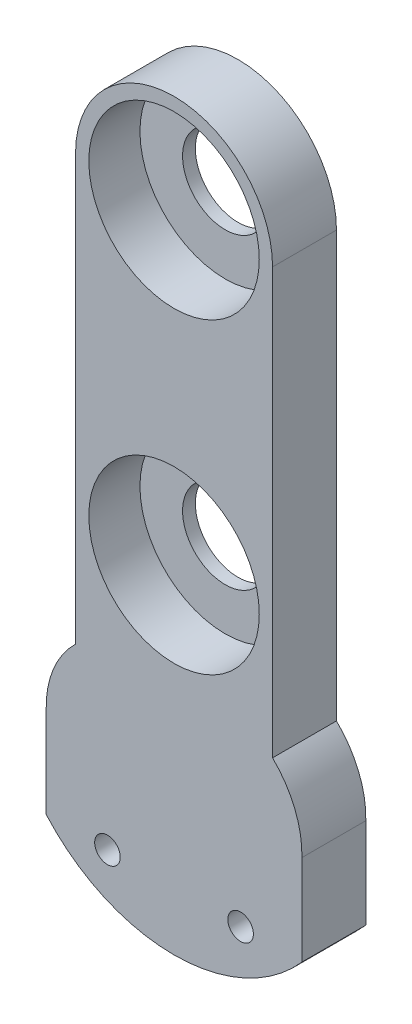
from build123d import *

# Parameters (mm, degrees)
SKETCH2_R           = 3
BOSS_EXTRUDE5_DEPTH = 15
SKETCH3_R           = 20
CUT_EXTRUDE1_DEPTH  = 12
SKETCH4_R           = 10
CUT_EXTRUDE2_DEPTH  = 15


with BuildPart() as part:
    # Sketch2 → Boss-Extrude5 (new body)
    with BuildSketch(Plane.XY):
        with BuildLine():
            Line((0, 21.234591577), (0, 0))
            ThreePointArc((0, 0), (30, -13.542486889), (60, 0))
            Line((60, 0), (60, 21.234591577))
            ThreePointArc((60, 21.234591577), (58.32131085, 30.371951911), (53.114528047, 38.066025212))
            Line((53.114528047, 38.066025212), (53.114528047, 137.820795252))
            ThreePointArc((53.114528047, 137.820795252), (30, 160.935323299), (6.885471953, 137.820795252))
            Line((6.885471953, 137.820795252), (6.885471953, 38.066025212))
            ThreePointArc((6.885471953, 38.066025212), (1.67868915, 30.371951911), (0, 21.234591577))
        make_face()
        with Locations((14.375, 0)):
            Circle(SKETCH2_R, mode=Mode.SUBTRACT)
        with Locations(Location((45.625, 0, 0), (0, 0, 180))):
            Circle(SKETCH2_R, mode=Mode.SUBTRACT)
    extrude(amount=BOSS_EXTRUDE5_DEPTH)

    # Sketch3 → Cut-Extrude1 (cut)
    with BuildSketch(Plane.XY.offset(15)):
        with Locations((30, 137.820795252)):
            Circle(SKETCH3_R)
        with Locations((30, 65.700795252)):
            Circle(SKETCH3_R)
    extrude(amount=-CUT_EXTRUDE1_DEPTH, mode=Mode.SUBTRACT)

    # Sketch4 → Cut-Extrude2 (cut)
    with BuildSketch(Plane.XY.offset(15)):
        with Locations((30, 137.820795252)):
            Circle(SKETCH4_R)
        with Locations((30, 65.700795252)):
            Circle(SKETCH4_R)
    extrude(amount=-CUT_EXTRUDE2_DEPTH, mode=Mode.SUBTRACT)


solid = part.part
